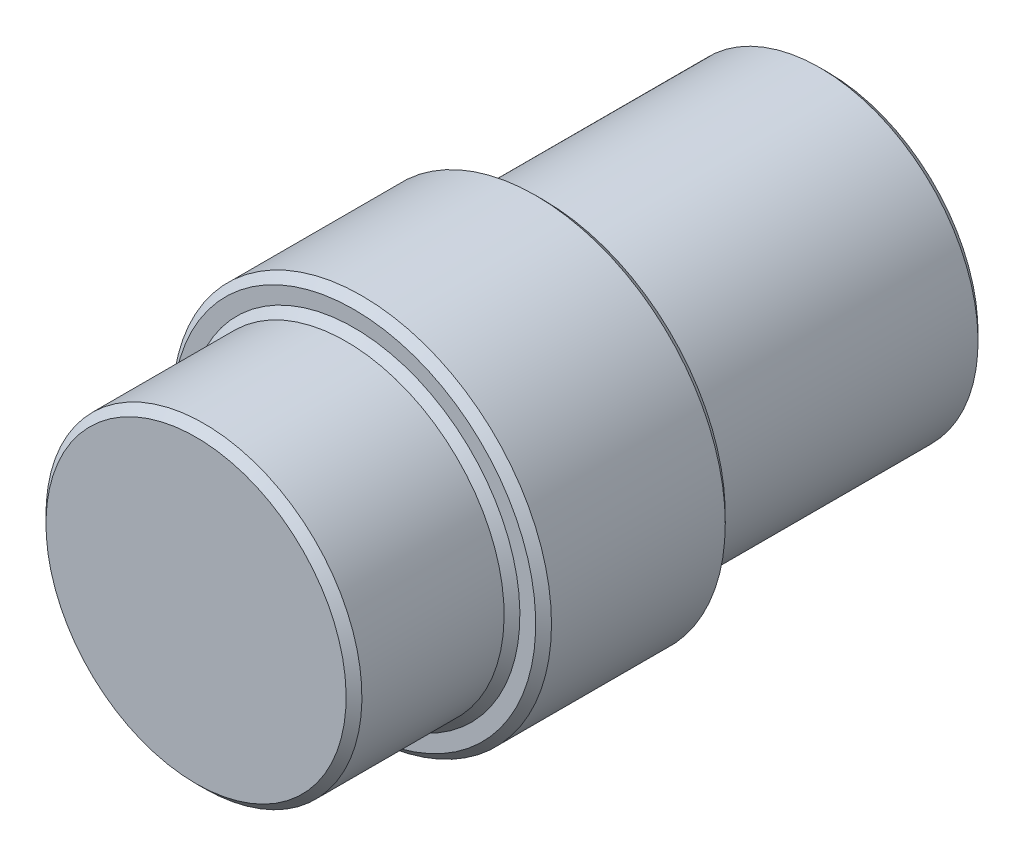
from build123d import *

# Parameters (mm, degrees)
CHAMFER_1_SIZE = 0.5


with BuildPart() as part:
    # Sketch 1 → Revolve 1 (revolve)
    with BuildSketch(Plane(origin=(0, 0, 0), x_dir=(0, 0, -1), z_dir=(1, 0, 0))):
        Polygon((0, 0), (0, 10), (10, 10), (10, 12), (22, 12), (22, 10), (40, 10), (40, 0), align=None)
    revolve(axis=Axis((0, 0, -40), (0, 0, 1)))

    # Chamfer 1
    chamfer_1_edges = [part.edges().sort_by_distance(p)[0] for p in [
        (0, -10, -40),
        (0, -10, -22),
        (0, -12, -22),
        (0, -12, -10),
        (0, -10, -10),
        (0, -10, 0),
    ]]
    chamfer(chamfer_1_edges, length=CHAMFER_1_SIZE)


solid = part.part
